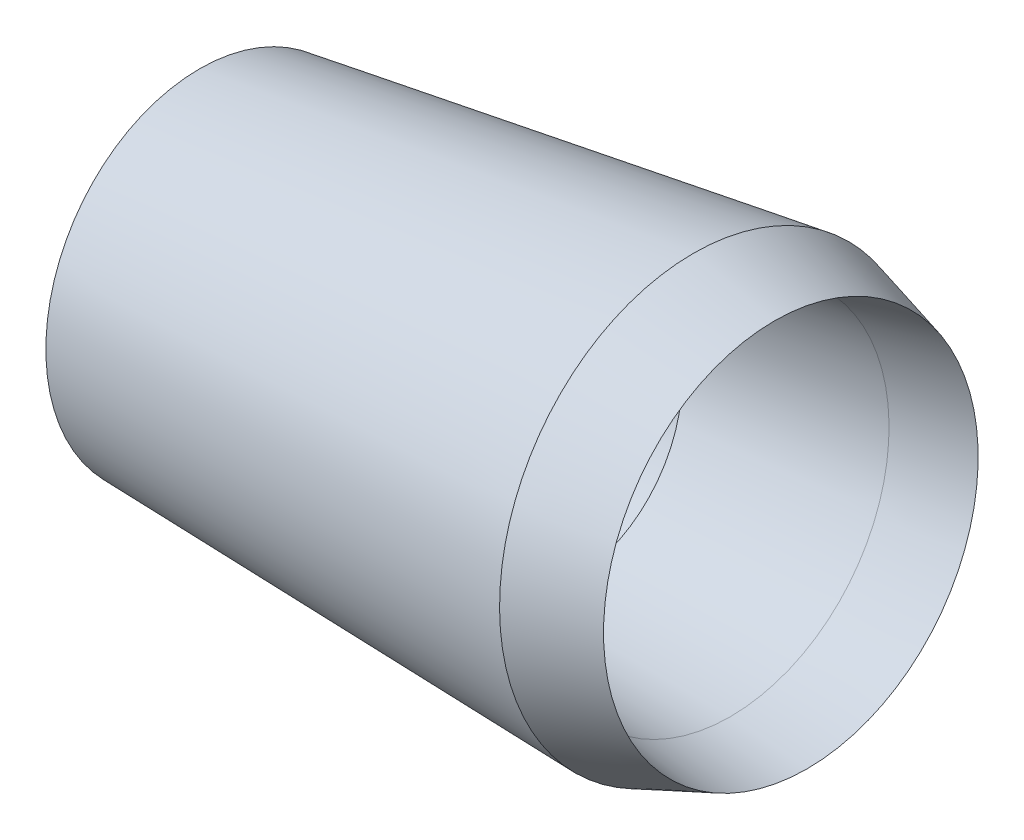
from build123d import *


with BuildPart() as part:
    # Sketch1 → Revolve2 (revolve)
    with BuildSketch(Plane.XY):
        with BuildLine():
            Line((0, 0), (6.35, -6.35))
            Line((6.35, -6.35), (50.8, -6.35))
            ThreePointArc((50.8, -6.35), (53.975, -9.525), (57.15, -6.35))
            ThreePointArc((57.15, -6.35), (60.325, -9.525), (63.5, -6.35))
            ThreePointArc((63.5, -6.35), (66.675, -9.525), (69.85, -6.35))
            ThreePointArc((69.85, -6.35), (73.025, -9.525), (76.2, -6.35))
            ThreePointArc((76.2, -6.35), (79.375, -9.525), (82.55, -6.35))
            ThreePointArc((82.55, -6.35), (85.725, -9.525), (88.9, -6.35))
            ThreePointArc((88.9, -6.35), (92.075, -9.525), (95.25, -6.35))
            ThreePointArc((95.25, -6.35), (98.425, -9.525), (101.6, -6.35))
            ThreePointArc((101.6, -6.35), (104.775, -9.525), (107.95, -6.35))
            ThreePointArc((107.95, -6.35), (111.125, -9.525), (114.3, -6.35))
            ThreePointArc((114.3, -6.35), (117.475, -9.525), (120.65, -6.35))
            ThreePointArc((120.65, -6.35), (123.825, -9.525), (127, -6.35))
            ThreePointArc((127, -6.35), (130.175, -9.525), (133.35, -6.35))
            ThreePointArc((133.35, -6.35), (136.525, -9.525), (139.7, -6.35))
            ThreePointArc((139.7, -6.35), (142.875, -9.525), (146.05, -6.35))
            ThreePointArc((146.05, -6.35), (149.225, -9.525), (152.4, -6.35))
            ThreePointArc((152.4, -6.35), (155.575, -9.525), (158.75, -6.35))
            ThreePointArc((158.75, -6.35), (161.925, -9.525), (165.1, -6.35))
            ThreePointArc((165.1, -6.35), (168.275, -9.525), (171.45, -6.35))
            ThreePointArc((171.45, -6.35), (174.625, -9.525), (177.8, -6.35))
            ThreePointArc((177.8, -6.35), (180.975, -9.525), (184.15, -6.35))
            ThreePointArc((184.15, -6.35), (187.325, -9.525), (190.5, -6.35))
            ThreePointArc((190.5, -6.35), (193.675, -9.525), (196.85, -6.35))
            ThreePointArc((196.85, -6.35), (200.025, -9.525), (203.2, -6.35))
            Line((203.2, -6.35), (292.1, -6.35))
            Line((292.1, -6.35), (304.8, -1.111106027))
            Line((304.8, -1.111106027), (292.1, 0))
            Line((292.1, 0), (259.461664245, 0))
            Line((259.461664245, 0), (265.811664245, 6.35))
            Line((265.811664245, 6.35), (262.636664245, 6.35))
            Line((262.636664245, 6.35), (256.286664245, 0))
            Line((256.286664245, 0), (243.586664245, 0))
            Line((243.586664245, 0), (249.936664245, 6.35))
            Line((249.936664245, 6.35), (246.761664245, 6.35))
            Line((246.761664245, 6.35), (240.411664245, 0))
            Line((240.411664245, 0), (227.711664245, 0))
            Line((227.711664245, 0), (234.061664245, 6.35))
            Line((234.061664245, 6.35), (230.886664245, 6.35))
            Line((230.886664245, 6.35), (224.536664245, 0))
            Line((224.536664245, 0), (211.836664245, 0))
            Line((211.836664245, 0), (218.186664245, 6.35))
            Line((218.186664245, 6.35), (215.011664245, 6.35))
            Line((215.011664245, 6.35), (208.661664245, 0))
            Line((208.661664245, 0), (195.961664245, 0))
            Line((195.961664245, 0), (202.311664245, 6.35))
            Line((202.311664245, 6.35), (199.136664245, 6.35))
            Line((199.136664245, 6.35), (192.786664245, 0))
            Line((192.786664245, 0), (180.086664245, 0))
            Line((180.086664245, 0), (186.436664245, 6.35))
            Line((186.436664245, 6.35), (183.261664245, 6.35))
            Line((183.261664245, 6.35), (176.911664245, 0))
            Line((176.911664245, 0), (164.211664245, 0))
            Line((164.211664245, 0), (170.561664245, 6.35))
            Line((170.561664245, 6.35), (167.386664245, 6.35))
            Line((167.386664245, 6.35), (161.036664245, 0))
            Line((161.036664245, 0), (148.336664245, 0))
            Line((148.336664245, 0), (154.686664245, 6.35))
            Line((154.686664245, 6.35), (151.511664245, 6.35))
            Line((151.511664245, 6.35), (145.161664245, 0))
            Line((145.161664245, 0), (132.461664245, 0))
            Line((132.461664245, 0), (138.811664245, 6.35))
            Line((138.811664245, 6.35), (135.636664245, 6.35))
            Line((135.636664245, 6.35), (129.286664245, 0))
            Line((129.286664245, 0), (116.586664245, 0))
            Line((116.586664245, 0), (122.936664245, 6.35))
            Line((122.936664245, 6.35), (119.761664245, 6.35))
            Line((119.761664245, 6.35), (113.411664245, 0))
            Line((113.411664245, 0), (100.711664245, 0))
            Line((100.711664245, 0), (107.061664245, 6.35))
            Line((107.061664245, 6.35), (103.886664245, 6.35))
            Line((103.886664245, 6.35), (97.536664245, 0))
            Line((97.536664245, 0), (0, 0))
        make_face()
    revolve(axis=Axis((29.791985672, 5.793588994, 0), (0.9961946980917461, 0.08715574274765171, 0)))

    # SurfaceCut4
    split(bisect_by=Plane(origin=(96.795763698, 8.468532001, 0), x_dir=(0, 0, -1), z_dir=(0.9961946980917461, 0.08715574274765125, 0)), keep=Keep.TOP)

    # SurfaceCut6
    split(bisect_by=Plane(origin=(207.076644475, 18.116858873, 0), x_dir=(0, 0, -1), z_dir=(0.9961946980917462, 0.08715574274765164, 0)), keep=Keep.TOP)


solid = part.part
